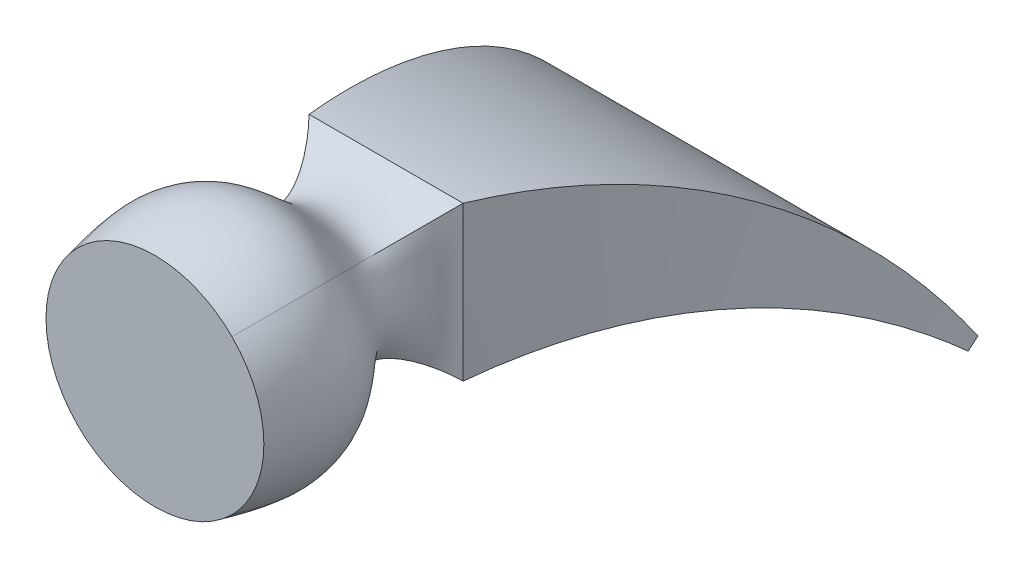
ISO-10303-21;
HEADER;
FILE_DESCRIPTION(('STEP AP214'),'2;1');
FILE_NAME('part.step','',(''),(''),'','','');
FILE_SCHEMA(('AUTOMOTIVE_DESIGN { 1 0 10303 214 1 1 1 1 }'));
ENDSEC;
DATA;
#1=APPLICATION_CONTEXT('core data for automotive mechanical design processes');
#2=APPLICATION_PROTOCOL_DEFINITION('international standard','automotive_design',2000,#1);
#3=PRODUCT_CONTEXT('',#1,'mechanical');
#4=PRODUCT('Part','Part','',(#3));
#5=PRODUCT_RELATED_PRODUCT_CATEGORY('part','',(#4));
#6=PRODUCT_DEFINITION_FORMATION('','',#4);
#7=PRODUCT_DEFINITION_CONTEXT('part definition',#1,'design');
#8=PRODUCT_DEFINITION('design','',#6,#7);
#9=PRODUCT_DEFINITION_SHAPE('','',#8);
#10=(LENGTH_UNIT() NAMED_UNIT(*) SI_UNIT(.MILLI.,.METRE.));
#11=(NAMED_UNIT(*) PLANE_ANGLE_UNIT() SI_UNIT($,.RADIAN.));
#12=(NAMED_UNIT(*) SI_UNIT($,.STERADIAN.) SOLID_ANGLE_UNIT());
#13=UNCERTAINTY_MEASURE_WITH_UNIT(LENGTH_MEASURE(1.E-05),#10,'distance_accuracy_value','');
#14=(GEOMETRIC_REPRESENTATION_CONTEXT(3) GLOBAL_UNCERTAINTY_ASSIGNED_CONTEXT((#13)) GLOBAL_UNIT_ASSIGNED_CONTEXT((#10,
#11,#12)) REPRESENTATION_CONTEXT('',''));
#15=CARTESIAN_POINT('',(0.,0.,0.));
#16=DIRECTION('',(0.,0.,1.));
#17=DIRECTION('',(1.,0.,0.));
#18=AXIS2_PLACEMENT_3D('',#15,#16,#17);
#19=CARTESIAN_POINT('',(0.,0.,90.));
#20=DIRECTION('',(0.,0.,1.));
#21=DIRECTION('',(1.,0.,0.));
#22=AXIS2_PLACEMENT_3D('',#19,#20,#21);
#23=PLANE('',#22);
#24=CARTESIAN_POINT('',(-30.,30.,90.));
#25=CARTESIAN_POINT('',(-13.442549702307,46.557450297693,90.));
#26=CARTESIAN_POINT('',(13.442549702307,46.557450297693,90.));
#27=CARTESIAN_POINT('',(30.,30.,90.));
#28=B_SPLINE_CURVE_WITH_KNOTS('',3,(#24,#25,#26,#27),.UNSPECIFIED.,.F.,.F.,(4,4),(0.,1.),.UNSPECIFIED.);
#29=CARTESIAN_POINT('',(30.,30.,90.));
#30=VERTEX_POINT('',#29);
#31=CARTESIAN_POINT('',(-30.,30.,90.));
#32=VERTEX_POINT('',#31);
#33=EDGE_CURVE('E13',#30,#32,#28,.F.);
#34=ORIENTED_EDGE('',*,*,#33,.T.);
#35=CARTESIAN_POINT('',(-30.,-30.,90.));
#36=CARTESIAN_POINT('',(-46.557450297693,-13.442549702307,90.));
#37=CARTESIAN_POINT('',(-46.557450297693,13.442549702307,90.));
#38=CARTESIAN_POINT('',(-30.,30.,90.));
#39=B_SPLINE_CURVE_WITH_KNOTS('',3,(#35,#36,#37,#38),.UNSPECIFIED.,.F.,.F.,(4,4),(0.,1.),.UNSPECIFIED.);
#40=CARTESIAN_POINT('',(-30.,-30.,90.));
#41=VERTEX_POINT('',#40);
#42=EDGE_CURVE('E253',#32,#41,#39,.F.);
#43=ORIENTED_EDGE('',*,*,#42,.T.);
#44=CARTESIAN_POINT('',(30.,-30.,90.));
#45=CARTESIAN_POINT('',(13.442549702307,-46.557450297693,90.));
#46=CARTESIAN_POINT('',(-13.442549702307,-46.557450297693,90.));
#47=CARTESIAN_POINT('',(-30.,-30.,90.));
#48=B_SPLINE_CURVE_WITH_KNOTS('',3,(#44,#45,#46,#47),.UNSPECIFIED.,.F.,.F.,(4,4),(0.,1.),.UNSPECIFIED.);
#49=CARTESIAN_POINT('',(30.,-30.,90.));
#50=VERTEX_POINT('',#49);
#51=EDGE_CURVE('E537',#41,#50,#48,.F.);
#52=ORIENTED_EDGE('',*,*,#51,.T.);
#53=CARTESIAN_POINT('',(30.,30.,90.));
#54=CARTESIAN_POINT('',(46.557450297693,13.442549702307,90.));
#55=CARTESIAN_POINT('',(46.557450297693,-13.442549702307,90.));
#56=CARTESIAN_POINT('',(30.,-30.,90.));
#57=B_SPLINE_CURVE_WITH_KNOTS('',3,(#53,#54,#55,#56),.UNSPECIFIED.,.F.,.F.,(4,4),(0.,1.),.UNSPECIFIED.);
#58=EDGE_CURVE('E534',#50,#30,#57,.F.);
#59=ORIENTED_EDGE('',*,*,#58,.T.);
#60=EDGE_LOOP('',(#34,#43,#52,#59));
#61=FACE_BOUND('',#60,.T.);
#62=ADVANCED_FACE('F241',(#61),#23,.T.);
#63=CARTESIAN_POINT('',(30.,30.,90.));
#64=CARTESIAN_POINT('',(31.5721069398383,31.5721069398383,80.5150489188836));
#65=CARTESIAN_POINT('',(37.4126053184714,37.4126053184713,48.7267112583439));
#66=CARTESIAN_POINT('',(10.0020018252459,10.0020018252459,28.4713034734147));
#67=CARTESIAN_POINT('',(24.5234086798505,24.5234086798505,5.55555555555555));
#68=CARTESIAN_POINT('',(30.,30.,0.));
#69=CARTESIAN_POINT('',(46.557450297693,13.442549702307,90.));
#70=CARTESIAN_POINT('',(48.1295572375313,13.9665853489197,80.5150489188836));
#71=CARTESIAN_POINT('',(55.6626313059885,16.2653307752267,48.7267112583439));
#72=CARTESIAN_POINT('',(22.2842511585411,5.88766998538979,28.4713034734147));
#73=CARTESIAN_POINT('',(24.5234086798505,8.17446955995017,5.55555555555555));
#74=CARTESIAN_POINT('',(30.,10.,0.));
#75=CARTESIAN_POINT('',(46.557450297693,-13.442549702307,90.));
#76=CARTESIAN_POINT('',(48.1295572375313,-13.9665853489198,80.5150489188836));
#77=CARTESIAN_POINT('',(55.6626313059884,-16.2653307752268,48.7267112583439));
#78=CARTESIAN_POINT('',(22.2842511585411,-5.8876699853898,28.4713034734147));
#79=CARTESIAN_POINT('',(24.5234086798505,-8.17446955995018,5.55555555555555));
#80=CARTESIAN_POINT('',(30.,-10.,0.));
#81=CARTESIAN_POINT('',(30.,-30.,90.));
#82=CARTESIAN_POINT('',(31.5721069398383,-31.5721069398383,80.5150489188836));
#83=CARTESIAN_POINT('',(37.4126053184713,-37.4126053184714,48.7267112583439));
#84=CARTESIAN_POINT('',(10.0020018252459,-10.0020018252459,28.4713034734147));
#85=CARTESIAN_POINT('',(24.5234086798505,-24.5234086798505,5.55555555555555));
#86=CARTESIAN_POINT('',(30.,-30.,0.));
#87=B_SPLINE_SURFACE_WITH_KNOTS('',3,3,((#63,#64,#65,#66,#67,#68),(#69,#70,#71,#72,#73,#74),
(#75,#76,#77,#78,#79,#80),(#81,#82,#83,#84,#85,#86)),.UNSPECIFIED.,.F.,.F.,.F.,(4,4),(4,1,1,4),
(0.,1.),(0.,0.406260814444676,0.715773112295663,1.),.UNSPECIFIED.);
#88=CARTESIAN_POINT('',(30.,-30.,90.));
#89=CARTESIAN_POINT('',(31.5721069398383,-31.5721069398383,80.5150489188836));
#90=CARTESIAN_POINT('',(37.4126053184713,-37.4126053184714,48.7267112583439));
#91=CARTESIAN_POINT('',(10.0020018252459,-10.0020018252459,28.4713034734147));
#92=CARTESIAN_POINT('',(24.5234086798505,-24.5234086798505,5.55555555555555));
#93=CARTESIAN_POINT('',(30.,-30.,0.));
#94=B_SPLINE_CURVE_WITH_KNOTS('',3,(#88,#89,#90,#91,#92,#93),.UNSPECIFIED.,.F.,.F.,(4,1,1,4),
(0.,0.406260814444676,0.715773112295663,1.),.UNSPECIFIED.);
#95=CARTESIAN_POINT('',(30.,-30.,0.));
#96=VERTEX_POINT('',#95);
#97=EDGE_CURVE('E512',#50,#96,#94,.T.);
#98=DIRECTION('',(0.,1.,0.));
#99=VECTOR('',#98,1.);
#100=CARTESIAN_POINT('',(30.0000000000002,7.12971348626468E-13,0.));
#101=LINE('',#100,#99);
#102=CARTESIAN_POINT('',(30.,30.,0.));
#103=VERTEX_POINT('',#102);
#104=EDGE_CURVE('E510',#96,#103,#101,.T.);
#105=CARTESIAN_POINT('',(30.,30.,0.));
#106=CARTESIAN_POINT('',(24.5234086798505,24.5234086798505,5.55555555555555));
#107=CARTESIAN_POINT('',(10.0020018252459,10.0020018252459,28.4713034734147));
#108=CARTESIAN_POINT('',(37.4126053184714,37.4126053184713,48.7267112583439));
#109=CARTESIAN_POINT('',(31.5721069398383,31.5721069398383,80.5150489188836));
#110=CARTESIAN_POINT('',(30.,30.,90.));
#111=B_SPLINE_CURVE_WITH_KNOTS('',3,(#105,#106,#107,#108,#109,#110),.UNSPECIFIED.,.F.,.F.,(4,1,
1,4),(0.,0.284226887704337,0.593739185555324,1.),.UNSPECIFIED.);
#112=EDGE_CURVE('E319',#103,#30,#111,.T.);
#113=ORIENTED_EDGE('',*,*,#58,.F.);
#114=ORIENTED_EDGE('',*,*,#97,.T.);
#115=ORIENTED_EDGE('',*,*,#104,.T.);
#116=ORIENTED_EDGE('',*,*,#112,.T.);
#117=EDGE_LOOP('',(#113,#114,#115,#116));
#118=FACE_BOUND('',#117,.T.);
#119=ADVANCED_FACE('F477',(#118),#87,.T.);
#120=CARTESIAN_POINT('',(30.,-30.,90.));
#121=CARTESIAN_POINT('',(31.5721069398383,-31.5721069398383,80.5150489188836));
#122=CARTESIAN_POINT('',(37.4126053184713,-37.4126053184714,48.7267112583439));
#123=CARTESIAN_POINT('',(10.0020018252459,-10.0020018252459,28.4713034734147));
#124=CARTESIAN_POINT('',(24.5234086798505,-24.5234086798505,5.55555555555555));
#125=CARTESIAN_POINT('',(30.,-30.,0.));
#126=CARTESIAN_POINT('',(13.442549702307,-46.557450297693,90.));
#127=CARTESIAN_POINT('',(13.9665853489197,-48.1295572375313,80.5150489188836));
#128=CARTESIAN_POINT('',(16.2653307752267,-55.6626313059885,48.7267112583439));
#129=CARTESIAN_POINT('',(5.88766998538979,-22.2842511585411,28.4713034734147));
#130=CARTESIAN_POINT('',(8.17446955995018,-24.5234086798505,5.55555555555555));
#131=CARTESIAN_POINT('',(10.,-30.,0.));
#132=CARTESIAN_POINT('',(-13.442549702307,-46.557450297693,90.));
#133=CARTESIAN_POINT('',(-13.9665853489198,-48.1295572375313,80.5150489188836));
#134=CARTESIAN_POINT('',(-16.2653307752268,-55.6626313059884,48.7267112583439));
#135=CARTESIAN_POINT('',(-5.8876699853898,-22.2842511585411,28.4713034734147));
#136=CARTESIAN_POINT('',(-8.17446955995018,-24.5234086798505,5.55555555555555));
#137=CARTESIAN_POINT('',(-10.,-30.,0.));
#138=CARTESIAN_POINT('',(-30.,-30.,90.));
#139=CARTESIAN_POINT('',(-31.5721069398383,-31.5721069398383,80.5150489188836));
#140=CARTESIAN_POINT('',(-37.4126053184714,-37.4126053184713,48.7267112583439));
#141=CARTESIAN_POINT('',(-10.0020018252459,-10.0020018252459,28.4713034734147));
#142=CARTESIAN_POINT('',(-24.5234086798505,-24.5234086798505,5.55555555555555));
#143=CARTESIAN_POINT('',(-30.,-30.,0.));
#144=B_SPLINE_SURFACE_WITH_KNOTS('',3,3,((#120,#121,#122,#123,#124,#125),(#126,#127,#128,#129,
#130,#131),(#132,#133,#134,#135,#136,#137),(#138,#139,#140,#141,#142,#143)),.UNSPECIFIED.,.F.,
.F.,.F.,(4,4),(4,1,1,4),(0.,1.),(0.,0.406260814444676,0.715773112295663,1.),.UNSPECIFIED.);
#145=CARTESIAN_POINT('',(-30.,-30.,90.));
#146=CARTESIAN_POINT('',(-31.5721069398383,-31.5721069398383,80.5150489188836));
#147=CARTESIAN_POINT('',(-37.4126053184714,-37.4126053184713,48.7267112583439));
#148=CARTESIAN_POINT('',(-10.0020018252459,-10.0020018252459,28.4713034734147));
#149=CARTESIAN_POINT('',(-24.5234086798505,-24.5234086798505,5.55555555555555));
#150=CARTESIAN_POINT('',(-30.,-30.,0.));
#151=B_SPLINE_CURVE_WITH_KNOTS('',3,(#145,#146,#147,#148,#149,#150),.UNSPECIFIED.,.F.,.F.,(4,1,
1,4),(0.,0.406260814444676,0.715773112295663,1.),.UNSPECIFIED.);
#152=CARTESIAN_POINT('',(-30.,-30.,0.));
#153=VERTEX_POINT('',#152);
#154=EDGE_CURVE('E461',#41,#153,#151,.T.);
#155=DIRECTION('',(1.,0.,0.));
#156=VECTOR('',#155,1.);
#157=CARTESIAN_POINT('',(0.,-30.,0.));
#158=LINE('',#157,#156);
#159=EDGE_CURVE('E324',#153,#96,#158,.T.);
#160=ORIENTED_EDGE('',*,*,#51,.F.);
#161=ORIENTED_EDGE('',*,*,#154,.T.);
#162=ORIENTED_EDGE('',*,*,#159,.T.);
#163=ORIENTED_EDGE('',*,*,#97,.F.);
#164=EDGE_LOOP('',(#160,#161,#162,#163));
#165=FACE_BOUND('',#164,.T.);
#166=ADVANCED_FACE('F466',(#165),#144,.T.);
#167=CARTESIAN_POINT('',(-30.,30.,90.));
#168=CARTESIAN_POINT('',(-31.5721069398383,31.5721069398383,80.5150489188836));
#169=CARTESIAN_POINT('',(-37.4126053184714,37.4126053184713,48.7267112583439));
#170=CARTESIAN_POINT('',(-10.0020018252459,10.0020018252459,28.4713034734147));
#171=CARTESIAN_POINT('',(-24.5234086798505,24.5234086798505,5.55555555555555));
#172=CARTESIAN_POINT('',(-30.,30.,0.));
#173=CARTESIAN_POINT('',(-13.442549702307,46.557450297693,90.));
#174=CARTESIAN_POINT('',(-13.9665853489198,48.1295572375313,80.5150489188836));
#175=CARTESIAN_POINT('',(-16.2653307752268,55.6626313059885,48.7267112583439));
#176=CARTESIAN_POINT('',(-5.8876699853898,22.2842511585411,28.4713034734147));
#177=CARTESIAN_POINT('',(-8.17446955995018,24.5234086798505,5.55555555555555));
#178=CARTESIAN_POINT('',(-10.,30.,0.));
#179=CARTESIAN_POINT('',(13.442549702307,46.557450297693,90.));
#180=CARTESIAN_POINT('',(13.9665853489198,48.1295572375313,80.5150489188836));
#181=CARTESIAN_POINT('',(16.2653307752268,55.6626313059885,48.7267112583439));
#182=CARTESIAN_POINT('',(5.88766998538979,22.2842511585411,28.4713034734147));
#183=CARTESIAN_POINT('',(8.17446955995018,24.5234086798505,5.55555555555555));
#184=CARTESIAN_POINT('',(10.,30.,0.));
#185=CARTESIAN_POINT('',(30.,30.,90.));
#186=CARTESIAN_POINT('',(31.5721069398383,31.5721069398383,80.5150489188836));
#187=CARTESIAN_POINT('',(37.4126053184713,37.4126053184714,48.7267112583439));
#188=CARTESIAN_POINT('',(10.0020018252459,10.0020018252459,28.4713034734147));
#189=CARTESIAN_POINT('',(24.5234086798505,24.5234086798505,5.55555555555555));
#190=CARTESIAN_POINT('',(30.,30.,0.));
#191=B_SPLINE_SURFACE_WITH_KNOTS('',3,3,((#167,#168,#169,#170,#171,#172),(#173,#174,#175,#176,
#177,#178),(#179,#180,#181,#182,#183,#184),(#185,#186,#187,#188,#189,#190)),.UNSPECIFIED.,.F.,
.F.,.F.,(4,4),(4,1,1,4),(0.,1.),(0.,0.406260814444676,0.715773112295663,1.),.UNSPECIFIED.);
#192=DIRECTION('',(-1.,0.,0.));
#193=VECTOR('',#192,1.);
#194=CARTESIAN_POINT('',(-4.54497550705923E-13,29.9999999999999,0.));
#195=LINE('',#194,#193);
#196=CARTESIAN_POINT('',(-30.,30.,0.));
#197=VERTEX_POINT('',#196);
#198=EDGE_CURVE('E312',#103,#197,#195,.T.);
#199=CARTESIAN_POINT('',(-30.,30.,90.));
#200=CARTESIAN_POINT('',(-31.5721069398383,31.5721069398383,80.5150489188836));
#201=CARTESIAN_POINT('',(-37.4126053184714,37.4126053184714,48.7267112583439));
#202=CARTESIAN_POINT('',(-10.0020018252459,10.0020018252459,28.4713034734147));
#203=CARTESIAN_POINT('',(-24.5234086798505,24.5234086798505,5.55555555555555));
#204=CARTESIAN_POINT('',(-30.,30.,0.));
#205=B_SPLINE_CURVE_WITH_KNOTS('',3,(#199,#200,#201,#202,#203,#204),.UNSPECIFIED.,.F.,.F.,(4,1,
1,4),(0.,0.406260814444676,0.715773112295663,1.),.UNSPECIFIED.);
#206=EDGE_CURVE('E303',#32,#197,#205,.T.);
#207=ORIENTED_EDGE('',*,*,#33,.F.);
#208=ORIENTED_EDGE('',*,*,#112,.F.);
#209=ORIENTED_EDGE('',*,*,#198,.T.);
#210=ORIENTED_EDGE('',*,*,#206,.F.);
#211=EDGE_LOOP('',(#207,#208,#209,#210));
#212=FACE_BOUND('',#211,.T.);
#213=ADVANCED_FACE('F317',(#212),#191,.T.);
#214=CARTESIAN_POINT('',(-30.,-30.,90.));
#215=CARTESIAN_POINT('',(-31.5721069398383,-31.5721069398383,80.5150489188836));
#216=CARTESIAN_POINT('',(-37.4126053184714,-37.4126053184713,48.7267112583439));
#217=CARTESIAN_POINT('',(-10.0020018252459,-10.0020018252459,28.4713034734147));
#218=CARTESIAN_POINT('',(-24.5234086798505,-24.5234086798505,5.55555555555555));
#219=CARTESIAN_POINT('',(-30.,-30.,0.));
#220=CARTESIAN_POINT('',(-46.557450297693,-13.442549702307,90.));
#221=CARTESIAN_POINT('',(-48.1295572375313,-13.9665853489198,80.5150489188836));
#222=CARTESIAN_POINT('',(-55.6626313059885,-16.2653307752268,48.7267112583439));
#223=CARTESIAN_POINT('',(-22.2842511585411,-5.88766998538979,28.4713034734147));
#224=CARTESIAN_POINT('',(-24.5234086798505,-8.17446955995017,5.55555555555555));
#225=CARTESIAN_POINT('',(-30.,-10.,0.));
#226=CARTESIAN_POINT('',(-46.557450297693,13.442549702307,90.));
#227=CARTESIAN_POINT('',(-48.1295572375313,13.9665853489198,80.5150489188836));
#228=CARTESIAN_POINT('',(-55.6626313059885,16.2653307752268,48.7267112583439));
#229=CARTESIAN_POINT('',(-22.2842511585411,5.8876699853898,28.4713034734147));
#230=CARTESIAN_POINT('',(-24.5234086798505,8.17446955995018,5.55555555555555));
#231=CARTESIAN_POINT('',(-30.,10.,0.));
#232=CARTESIAN_POINT('',(-30.,30.,90.));
#233=CARTESIAN_POINT('',(-31.5721069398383,31.5721069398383,80.5150489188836));
#234=CARTESIAN_POINT('',(-37.4126053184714,37.4126053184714,48.7267112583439));
#235=CARTESIAN_POINT('',(-10.0020018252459,10.0020018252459,28.4713034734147));
#236=CARTESIAN_POINT('',(-24.5234086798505,24.5234086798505,5.55555555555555));
#237=CARTESIAN_POINT('',(-30.,30.,0.));
#238=B_SPLINE_SURFACE_WITH_KNOTS('',3,3,((#214,#215,#216,#217,#218,#219),(#220,#221,#222,#223,
#224,#225),(#226,#227,#228,#229,#230,#231),(#232,#233,#234,#235,#236,#237)),.UNSPECIFIED.,.F.,
.F.,.F.,(4,4),(4,1,1,4),(0.,1.),(0.,0.406260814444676,0.715773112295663,1.),.UNSPECIFIED.);
#239=DIRECTION('',(0.,-1.,0.));
#240=VECTOR('',#239,1.);
#241=CARTESIAN_POINT('',(-29.9999999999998,-5.98479599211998E-13,0.));
#242=LINE('',#241,#240);
#243=EDGE_CURVE('E293',#197,#153,#242,.T.);
#244=ORIENTED_EDGE('',*,*,#42,.F.);
#245=ORIENTED_EDGE('',*,*,#206,.T.);
#246=ORIENTED_EDGE('',*,*,#243,.T.);
#247=ORIENTED_EDGE('',*,*,#154,.F.);
#248=EDGE_LOOP('',(#244,#245,#246,#247));
#249=FACE_BOUND('',#248,.T.);
#250=ADVANCED_FACE('F308',(#249),#238,.T.);
#251=CARTESIAN_POINT('',(-75.,-73.2383057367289,-151.698786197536));
#252=DIRECTION('',(0.,0.766044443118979,0.642787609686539));
#253=DIRECTION('',(1.,0.,0.));
#254=AXIS2_PLACEMENT_3D('',#251,#252,#253);
#255=PLANE('',#254);
#256=DIRECTION('',(0.,-0.642787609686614,0.766044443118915));
#257=VECTOR('',#256,1.);
#258=CARTESIAN_POINT('',(-75.,-71.6313367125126,-153.613897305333));
#259=LINE('',#258,#257);
#260=CARTESIAN_POINT('',(-75.,-70.0243676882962,-155.529008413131));
#261=VERTEX_POINT('',#260);
#262=CARTESIAN_POINT('',(-75.,-73.2383057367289,-151.698786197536));
#263=VERTEX_POINT('',#262);
#264=EDGE_CURVE('E331',#261,#263,#259,.T.);
#265=ORIENTED_EDGE('',*,*,#264,.F.);
#266=DIRECTION('',(-1.,0.,0.));
#267=VECTOR('',#266,1.);
#268=CARTESIAN_POINT('',(-2.44249065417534E-12,-70.024367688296,-155.529008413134));
#269=LINE('',#268,#267);
#270=CARTESIAN_POINT('',(75.,-70.0243676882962,-155.529008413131));
#271=VERTEX_POINT('',#270);
#272=EDGE_CURVE('E329',#271,#261,#269,.T.);
#273=ORIENTED_EDGE('',*,*,#272,.F.);
#274=DIRECTION('',(0.,0.642787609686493,-0.766044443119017));
#275=VECTOR('',#274,1.);
#276=CARTESIAN_POINT('',(75.,-71.6313367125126,-153.613897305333));
#277=LINE('',#276,#275);
#278=CARTESIAN_POINT('',(75.,-73.2383057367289,-151.698786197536));
#279=VERTEX_POINT('',#278);
#280=EDGE_CURVE('E384',#279,#271,#277,.T.);
#281=ORIENTED_EDGE('',*,*,#280,.F.);
#282=DIRECTION('',(1.,0.,0.));
#283=VECTOR('',#282,1.);
#284=CARTESIAN_POINT('',(1.7052331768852E-12,-73.2383057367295,-151.698786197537));
#285=LINE('',#284,#283);
#286=EDGE_CURVE('E407',#263,#279,#285,.T.);
#287=ORIENTED_EDGE('',*,*,#286,.F.);
#288=EDGE_LOOP('',(#265,#273,#281,#287));
#289=FACE_BOUND('',#288,.T.);
#290=ADVANCED_FACE('F243',(#289),#255,.F.);
#291=CARTESIAN_POINT('',(-75.,-91.1463685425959,-130.356788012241));
#292=CARTESIAN_POINT('',(-75.,-78.1363473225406,-145.861527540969));
#293=CARTESIAN_POINT('',(-75.,-65.1263261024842,-161.366267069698));
#294=CARTESIAN_POINT('',(-75.,-52.1163048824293,-176.871006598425));
#295=CARTESIAN_POINT('',(-70.1787201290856,-78.9584578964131,-120.129826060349));
#296=CARTESIAN_POINT('',(-70.1787233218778,-64.4988050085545,-134.418169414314));
#297=CARTESIAN_POINT('',(-70.1787251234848,-50.0391511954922,-148.706511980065));
#298=CARTESIAN_POINT('',(-70.1787265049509,-35.5794968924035,-162.994854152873));
#299=CARTESIAN_POINT('',(-62.1428863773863,-61.0572602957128,-100.213730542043));
#300=CARTESIAN_POINT('',(-62.142886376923,-44.4684167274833,-112.133230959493));
#301=CARTESIAN_POINT('',(-62.1428863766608,-27.8795731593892,-124.052731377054));
#302=CARTESIAN_POINT('',(-62.1428863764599,-11.2907295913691,-135.972231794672));
#303=CARTESIAN_POINT('',(-51.9642856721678,-44.9227971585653,-70.5858759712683));
#304=CARTESIAN_POINT('',(-51.9642856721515,-26.4149077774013,-78.981415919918));
#305=CARTESIAN_POINT('',(-51.9642856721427,-7.90701839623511,-87.3769558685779));
#306=CARTESIAN_POINT('',(-51.9642856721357,10.6008709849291,-95.7724958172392));
#307=CARTESIAN_POINT('',(-41.7856839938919,-33.6095763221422,-38.8897060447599));
#308=CARTESIAN_POINT('',(-41.785683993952,-13.7560835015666,-43.5152784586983));
#309=CARTESIAN_POINT('',(-41.7856839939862,6.09740931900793,-48.1408508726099));
#310=CARTESIAN_POINT('',(-41.7856839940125,25.9509021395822,-52.7664232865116));
#311=CARTESIAN_POINT('',(-34.8212798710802,-30.3599305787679,-15.9102456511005));
#312=CARTESIAN_POINT('',(-34.8212766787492,-10.1199223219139,-17.8026123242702));
#313=CARTESIAN_POINT('',(-34.821274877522,10.1200859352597,-19.6949802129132));
#314=CARTESIAN_POINT('',(-34.8212734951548,30.3600941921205,-21.5873487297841));
#315=CARTESIAN_POINT('',(-30.,-30.36,0.));
#316=CARTESIAN_POINT('',(-30.0000000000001,-10.1200000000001,0.));
#317=CARTESIAN_POINT('',(-30.,10.1200000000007,0.));
#318=CARTESIAN_POINT('',(-30.,30.36,0.));
#319=B_SPLINE_SURFACE_WITH_KNOTS('',3,3,((#291,#292,#293,#294),(#295,#296,#297,#298),(#299,#300,
#301,#302),(#303,#304,#305,#306),(#307,#308,#309,#310),(#311,#312,#313,#314),(#315,#316,#317,
#318)),.UNSPECIFIED.,.F.,.F.,.F.,(4,1,1,1,4),(4,4),(0.,0.321429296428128,0.535714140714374,
0.678570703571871,1.),(0.,1.),.UNSPECIFIED.);
#320=CARTESIAN_POINT('',(-30.,30.,0.));
#321=CARTESIAN_POINT('',(-30.9342195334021,29.4290971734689,-4.17642962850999));
#322=CARTESIAN_POINT('',(-31.8716699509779,28.7417679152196,-8.33623197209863));
#323=CARTESIAN_POINT('',(-33.7466319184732,27.1421054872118,-16.5807449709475));
#324=CARTESIAN_POINT('',(-34.6840974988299,26.2313740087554,-20.6657769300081));
#325=CARTESIAN_POINT('',(-36.5590841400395,24.1919290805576,-28.7489334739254));
#326=CARTESIAN_POINT('',(-37.496558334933,23.064795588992,-32.7474674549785));
#327=CARTESIAN_POINT('',(-39.3715636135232,20.599501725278,-40.646153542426));
#328=CARTESIAN_POINT('',(-40.3090468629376,19.2628993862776,-44.5468031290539));
#329=CARTESIAN_POINT('',(-42.1840735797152,16.3856143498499,-52.2386467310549));
#330=CARTESIAN_POINT('',(-43.1215685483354,14.8464615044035,-56.0304245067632));
#331=CARTESIAN_POINT('',(-44.996594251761,11.570803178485,-63.4936577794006));
#332=CARTESIAN_POINT('',(-45.9340765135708,9.83579218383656,-67.1657811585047));
#333=CARTESIAN_POINT('',(-47.8090862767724,6.17730605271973,-74.3798630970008));
#334=CARTESIAN_POINT('',(-48.7465646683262,4.25528071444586,-77.922569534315));
#335=CARTESIAN_POINT('',(-50.621571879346,0.231657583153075,-84.8682822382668));
#336=CARTESIAN_POINT('',(-51.5590507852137,-1.86853315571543,-88.2721168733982));
#337=CARTESIAN_POINT('',(-53.4340555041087,-6.23880526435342,-94.9313248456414));
#338=CARTESIAN_POINT('',(-54.3715306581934,-8.50752928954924,-98.1876031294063));
#339=CARTESIAN_POINT('',(-56.2465378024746,-13.2046150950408,-104.543686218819));
#340=CARTESIAN_POINT('',(-57.1840181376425,-15.6316727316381,-107.644469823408));
#341=CARTESIAN_POINT('',(-59.0590399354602,-20.6355869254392,-113.681721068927));
#342=CARTESIAN_POINT('',(-59.9965290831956,-23.2111950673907,-116.619239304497));
#343=CARTESIAN_POINT('',(-61.8715500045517,-28.5021305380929,-122.322619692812));
#344=CARTESIAN_POINT('',(-62.8090292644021,-31.2162719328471,-125.089599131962));
#345=CARTESIAN_POINT('',(-64.6840378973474,-36.7724476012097,-130.446388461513));
#346=CARTESIAN_POINT('',(-65.6215137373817,-39.6133649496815,-133.037375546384));
#347=CARTESIAN_POINT('',(-67.4965159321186,-45.411678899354,-138.036783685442));
#348=CARTESIAN_POINT('',(-68.4339875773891,-48.3680241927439,-140.446444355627));
#349=CARTESIAN_POINT('',(-70.3089857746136,-54.3860036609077,-145.078130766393));
#350=CARTESIAN_POINT('',(-71.2464566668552,-57.4466554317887,-147.301454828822));
#351=CARTESIAN_POINT('',(-73.1214407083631,-63.662202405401,-151.555621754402));
#352=CARTESIAN_POINT('',(-74.0588979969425,-66.8161909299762,-153.587814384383));
#353=CARTESIAN_POINT('',(-75.,-70.0243676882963,-155.529008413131));
#354=B_SPLINE_CURVE_WITH_KNOTS('',3,(#320,#321,#322,#323,#324,#325,#326,#327,#328,#329,#330,
#331,#332,#333,#334,#335,#336,#337,#338,#339,#340,#341,#342,#343,#344,#345,#346,#347,#348,#349,
#350,#351,#352,#353),.UNSPECIFIED.,.F.,.F.,(4,2,2,2,2,2,2,2,2,2,2,2,2,2,2,2,4),(0.,
12.9510719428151,25.811873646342,38.5821226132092,51.2615383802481,63.8501630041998,
76.348507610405,88.7566935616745,101.074673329,113.302411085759,125.43975288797,
137.486821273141,149.443998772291,161.311138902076,173.087942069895,184.774345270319,
196.37080138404),.UNSPECIFIED.);
#355=EDGE_CURVE('E297',#197,#261,#354,.T.);
#356=CARTESIAN_POINT('',(-30.,-29.9999999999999,0.));
#357=CARTESIAN_POINT('',(-30.9426112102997,-29.4239307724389,-3.11719668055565));
#358=CARTESIAN_POINT('',(-31.8810737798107,-28.9367052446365,-6.25190727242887));
#359=CARTESIAN_POINT('',(-33.7579408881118,-28.1353745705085,-12.5736983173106));
#360=CARTESIAN_POINT('',(-34.6962732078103,-27.8228199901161,-15.7609970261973));
#361=CARTESIAN_POINT('',(-36.5728581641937,-27.3743474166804,-22.1785525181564));
#362=CARTESIAN_POINT('',(-37.5110375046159,-27.2400072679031,-25.4089405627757));
#363=CARTESIAN_POINT('',(-39.3873291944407,-27.1514282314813,-31.902794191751));
#364=CARTESIAN_POINT('',(-40.3253692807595,-27.1987738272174,-35.1663020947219));
#365=CARTESIAN_POINT('',(-42.2013723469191,-27.47692790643,-41.7159317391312));
#366=CARTESIAN_POINT('',(-43.1392653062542,-27.7093104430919,-45.0020066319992));
#367=CARTESIAN_POINT('',(-45.0150343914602,-28.3612302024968,-51.5857193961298));
#368=CARTESIAN_POINT('',(-45.9528439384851,-28.7823261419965,-54.8832218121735));
#369=CARTESIAN_POINT('',(-47.8284043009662,-29.8133001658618,-61.4792493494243));
#370=CARTESIAN_POINT('',(-48.766088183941,-30.4247373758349,-64.777549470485));
#371=CARTESIAN_POINT('',(-50.6413719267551,-31.8368887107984,-71.3648487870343));
#372=CARTESIAN_POINT('',(-51.5789039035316,-32.6391610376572,-74.6535329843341));
#373=CARTESIAN_POINT('',(-53.453894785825,-34.4335551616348,-81.2107052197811));
#374=CARTESIAN_POINT('',(-54.3912867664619,-35.4272168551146,-84.4787908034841));
#375=CARTESIAN_POINT('',(-56.2659962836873,-37.6046914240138,-90.9833590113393));
#376=CARTESIAN_POINT('',(-57.2032490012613,-38.7900099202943,-94.219356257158));
#377=CARTESIAN_POINT('',(-59.077722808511,-41.3510909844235,-100.647817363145));
#378=CARTESIAN_POINT('',(-60.0148817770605,-42.7283225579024,-103.839713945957));
#379=CARTESIAN_POINT('',(-61.8891143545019,-45.6715021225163,-110.169020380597));
#380=CARTESIAN_POINT('',(-62.8261258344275,-47.2388878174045,-113.305779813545));
#381=CARTESIAN_POINT('',(-64.7000903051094,-50.5604637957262,-119.513587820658));
#382=CARTESIAN_POINT('',(-65.6369822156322,-52.3160550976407,-122.583905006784));
#383=CARTESIAN_POINT('',(-67.5106984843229,-56.011275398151,-128.647878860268));
#384=CARTESIAN_POINT('',(-68.447462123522,-57.9522665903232,-131.640723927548));
#385=CARTESIAN_POINT('',(-70.3209022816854,-62.0147138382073,-137.539056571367));
#386=CARTESIAN_POINT('',(-71.2575183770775,-64.1374871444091,-140.443655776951));
#387=CARTESIAN_POINT('',(-73.1306783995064,-68.5597483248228,-146.15430802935));
#388=CARTESIAN_POINT('',(-74.0671636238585,-70.8604966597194,-148.959404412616));
#389=CARTESIAN_POINT('',(-75.,-73.2383057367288,-151.698786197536));
#390=B_SPLINE_CURVE_WITH_KNOTS('',3,(#356,#357,#358,#359,#360,#361,#362,#363,#364,#365,#366,
#367,#368,#369,#370,#371,#372,#373,#374,#375,#376,#377,#378,#379,#380,#381,#382,#383,#384,#385,
#386,#387,#388,#389),.UNSPECIFIED.,.F.,.F.,(4,2,2,2,2,2,2,2,2,2,2,2,2,2,2,2,4),(0.,
9.92001909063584,19.9267542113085,30.021506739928,40.2044949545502,50.475044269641,
60.8320351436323,71.2761996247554,81.8087614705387,92.4299024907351,103.138943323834,
113.934988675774,124.818447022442,135.789437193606,146.848353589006,157.995575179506,
169.230618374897),.UNSPECIFIED.);
#391=EDGE_CURVE('E300',#153,#263,#390,.T.);
#392=ORIENTED_EDGE('',*,*,#355,.T.);
#393=ORIENTED_EDGE('',*,*,#264,.T.);
#394=ORIENTED_EDGE('',*,*,#391,.F.);
#395=ORIENTED_EDGE('',*,*,#243,.F.);
#396=EDGE_LOOP('',(#392,#393,#394,#395));
#397=FACE_BOUND('',#396,.T.);
#398=ADVANCED_FACE('F294',(#397),#319,.T.);
#399=CARTESIAN_POINT('',(-75.9,-30.,0.));
#400=CARTESIAN_POINT('',(-25.2999999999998,-29.9999999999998,0.));
#401=CARTESIAN_POINT('',(25.299999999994,-29.9999999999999,0.));
#402=CARTESIAN_POINT('',(75.9000000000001,-30.,0.));
#403=CARTESIAN_POINT('',(-75.9,-26.8644013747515,-16.9680111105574));
#404=CARTESIAN_POINT('',(-25.3000000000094,-26.8644013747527,-16.9680111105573));
#405=CARTESIAN_POINT('',(25.2999999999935,-26.8644013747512,-16.9680111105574));
#406=CARTESIAN_POINT('',(75.8999999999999,-26.8644013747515,-16.9680111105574));
#407=CARTESIAN_POINT('',(-75.8999999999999,-25.9060151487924,-50.6513581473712));
#408=CARTESIAN_POINT('',(-25.3000000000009,-25.906015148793,-50.6513581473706));
#409=CARTESIAN_POINT('',(25.2999999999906,-25.9060151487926,-50.651358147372));
#410=CARTESIAN_POINT('',(75.8999999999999,-25.9060151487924,-50.6513581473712));
#411=CARTESIAN_POINT('',(-75.8999999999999,-36.4291911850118,-91.2994598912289));
#412=CARTESIAN_POINT('',(-25.2999999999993,-36.4291911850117,-91.2994598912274));
#413=CARTESIAN_POINT('',(25.2999999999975,-36.4291911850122,-91.299459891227));
#414=CARTESIAN_POINT('',(75.9,-36.4291911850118,-91.2994598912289));
#415=CARTESIAN_POINT('',(-75.9,-52.6278076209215,-124.798591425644));
#416=CARTESIAN_POINT('',(-25.2999999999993,-52.6278076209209,-124.798591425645));
#417=CARTESIAN_POINT('',(25.2999999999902,-52.6278076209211,-124.798591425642));
#418=CARTESIAN_POINT('',(75.9000000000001,-52.6278076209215,-124.798591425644));
#419=CARTESIAN_POINT('',(-75.9000000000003,-64.871981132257,-142.060261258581));
#420=CARTESIAN_POINT('',(-25.2999999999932,-64.8719811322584,-142.060261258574));
#421=CARTESIAN_POINT('',(25.2999999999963,-64.8719811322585,-142.060261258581));
#422=CARTESIAN_POINT('',(75.9000000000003,-64.871981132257,-142.060261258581));
#423=CARTESIAN_POINT('',(-75.9,-73.2383057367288,-151.698786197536));
#424=CARTESIAN_POINT('',(-25.2999999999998,-73.2383057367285,-151.698786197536));
#425=CARTESIAN_POINT('',(25.299999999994,-73.2383057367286,-151.698786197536));
#426=CARTESIAN_POINT('',(75.9000000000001,-73.2383057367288,-151.698786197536));
#427=B_SPLINE_SURFACE_WITH_KNOTS('',3,3,((#399,#400,#401,#402),(#403,#404,#405,#406),(#407,#408,
#409,#410),(#411,#412,#413,#414),(#415,#416,#417,#418),(#419,#420,#421,#422),(#423,#424,#425,
#426)),.UNSPECIFIED.,.F.,.F.,.F.,(4,1,1,1,4),(4,4),(0.,0.31729513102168,0.61278754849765,
0.765308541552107,1.),(0.,1.),.UNSPECIFIED.);
#428=CARTESIAN_POINT('',(30.,-30.,0.));
#429=CARTESIAN_POINT('',(30.941652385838,-29.4245232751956,-3.11406457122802));
#430=CARTESIAN_POINT('',(31.8791029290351,-28.9376610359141,-6.24561762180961));
#431=CARTESIAN_POINT('',(33.7540908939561,-28.1365463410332,-12.5616118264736));
#432=CARTESIAN_POINT('',(34.6915543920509,-27.8238734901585,-15.7462755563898));
#433=CARTESIAN_POINT('',(36.5665550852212,-27.3747797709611,-22.1588387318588));
#434=CARTESIAN_POINT('',(37.5040187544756,-27.2399514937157,-25.3868707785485));
#435=CARTESIAN_POINT('',(39.3790220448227,-27.1501232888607,-31.876253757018));
#436=CARTESIAN_POINT('',(40.3164894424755,-27.1967195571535,-35.1376474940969));
#437=CARTESIAN_POINT('',(42.1914975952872,-27.4732285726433,-41.6834548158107));
#438=CARTESIAN_POINT('',(43.128967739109,-27.7047359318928,-44.9678212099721));
#439=CARTESIAN_POINT('',(45.0039888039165,-28.3546892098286,-51.5488994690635));
#440=CARTESIAN_POINT('',(45.941470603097,-28.7747311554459,-54.8454732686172));
#441=CARTESIAN_POINT('',(47.8164942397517,-29.8032463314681,-61.4403591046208));
#442=CARTESIAN_POINT('',(48.7539673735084,-30.4133076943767,-64.7384426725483));
#443=CARTESIAN_POINT('',(50.628975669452,-31.8228875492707,-71.3255709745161));
#444=CARTESIAN_POINT('',(51.5664430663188,-32.6239786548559,-74.6142982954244));
#445=CARTESIAN_POINT('',(53.4414482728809,-34.416745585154,-81.1715280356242));
#446=CARTESIAN_POINT('',(54.3789196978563,-35.409975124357,-84.439624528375));
#447=CARTESIAN_POINT('',(56.2539278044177,-37.5873343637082,-90.944313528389));
#448=CARTESIAN_POINT('',(57.1913991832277,-38.7729942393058,-94.1804124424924));
#449=CARTESIAN_POINT('',(59.066409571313,-41.3345776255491,-100.609861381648));
#450=CARTESIAN_POINT('',(60.0038843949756,-42.7120004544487,-103.802632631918));
#451=CARTESIAN_POINT('',(61.8789112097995,-45.6562445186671,-110.133978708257));
#452=CARTESIAN_POINT('',(62.8163999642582,-47.2245352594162,-113.271888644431));
#453=CARTESIAN_POINT('',(64.6914284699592,-50.5477762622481,-119.482850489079));
#454=CARTESIAN_POINT('',(65.6289050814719,-52.3041571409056,-122.555155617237));
#455=CARTESIAN_POINT('',(67.5039112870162,-56.0007999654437,-128.62394999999));
#456=CARTESIAN_POINT('',(68.4413786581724,-57.9424477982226,-131.619614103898));
#457=CARTESIAN_POINT('',(70.3163654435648,-62.0065621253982,-137.523892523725));
#458=CARTESIAN_POINT('',(71.2538239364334,-64.1303642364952,-140.431606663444));
#459=CARTESIAN_POINT('',(73.1287854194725,-68.5555079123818,-146.148488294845));
#460=CARTESIAN_POINT('',(74.0662287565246,-70.8581339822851,-148.956681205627));
#461=CARTESIAN_POINT('',(74.9999999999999,-73.2383057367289,-151.698786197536));
#462=B_SPLINE_CURVE_WITH_KNOTS('',3,(#428,#429,#430,#431,#432,#433,#434,#435,#436,#437,#438,
#439,#440,#441,#442,#443,#444,#445,#446,#447,#448,#449,#450,#451,#452,#453,#454,#455,#456,#457,
#458,#459,#460,#461),.UNSPECIFIED.,.F.,.F.,(4,2,2,2,2,2,2,2,2,2,2,2,2,2,2,2,4),(0.,
9.91003971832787,19.908541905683,29.995985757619,40.1723798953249,50.4374918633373,
60.7911911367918,71.2338573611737,81.7656539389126,92.3864723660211,103.096304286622,
113.895141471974,124.783115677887,135.760740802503,146.828110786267,157.985006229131,
169.231165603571),.UNSPECIFIED.);
#463=EDGE_CURVE('E391',#96,#279,#462,.T.);
#464=ORIENTED_EDGE('',*,*,#391,.T.);
#465=ORIENTED_EDGE('',*,*,#286,.T.);
#466=ORIENTED_EDGE('',*,*,#463,.F.);
#467=ORIENTED_EDGE('',*,*,#159,.F.);
#468=EDGE_LOOP('',(#464,#465,#466,#467));
#469=FACE_BOUND('',#468,.T.);
#470=ADVANCED_FACE('F352',(#469),#427,.T.);
#471=CARTESIAN_POINT('',(-75.9000000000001,-70.0243676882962,-155.529008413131));
#472=CARTESIAN_POINT('',(-25.2999999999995,-70.0243676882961,-155.52900841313));
#473=CARTESIAN_POINT('',(25.2999999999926,-70.0243676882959,-155.52900841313));
#474=CARTESIAN_POINT('',(75.9,-70.0243676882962,-155.529008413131));
#475=CARTESIAN_POINT('',(-75.9000000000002,-56.5373267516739,-147.368263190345));
#476=CARTESIAN_POINT('',(-25.2999999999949,-56.5373267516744,-147.368263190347));
#477=CARTESIAN_POINT('',(25.299999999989,-56.5373267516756,-147.368263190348));
#478=CARTESIAN_POINT('',(75.9,-56.5373267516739,-147.368263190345));
#479=CARTESIAN_POINT('',(-75.9,-34.8241357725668,-130.445937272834));
#480=CARTESIAN_POINT('',(-25.3000000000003,-34.8241357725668,-130.445937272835));
#481=CARTESIAN_POINT('',(25.2999999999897,-34.8241357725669,-130.445937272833));
#482=CARTESIAN_POINT('',(75.9,-34.8241357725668,-130.445937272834));
#483=CARTESIAN_POINT('',(-75.9000000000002,-10.7022757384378,-102.476091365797));
#484=CARTESIAN_POINT('',(-25.2999999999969,-10.702275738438,-102.476091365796));
#485=CARTESIAN_POINT('',(25.2999999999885,-10.7022757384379,-102.476091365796));
#486=CARTESIAN_POINT('',(75.9000000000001,-10.7022757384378,-102.476091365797));
#487=CARTESIAN_POINT('',(-75.9,7.02623328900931,-74.4190992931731));
#488=CARTESIAN_POINT('',(-25.3000000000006,7.02623328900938,-74.4190992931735));
#489=CARTESIAN_POINT('',(25.2999999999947,7.02623328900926,-74.4190992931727));
#490=CARTESIAN_POINT('',(75.8999999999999,7.02623328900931,-74.4190992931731));
#491=CARTESIAN_POINT('',(-75.9000000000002,21.7359865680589,-41.0163669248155));
#492=CARTESIAN_POINT('',(-25.2999999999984,21.7359865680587,-41.0163669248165));
#493=CARTESIAN_POINT('',(25.2999999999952,21.7359865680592,-41.0163669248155));
#494=CARTESIAN_POINT('',(75.9000000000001,21.7359865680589,-41.0163669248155));
#495=CARTESIAN_POINT('',(-75.9000000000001,27.9900090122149,-14.7040205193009));
#496=CARTESIAN_POINT('',(-25.3000000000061,27.990009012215,-14.7040205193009));
#497=CARTESIAN_POINT('',(25.2999999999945,27.9900090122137,-14.7040205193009));
#498=CARTESIAN_POINT('',(75.9000000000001,27.9900090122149,-14.7040205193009));
#499=CARTESIAN_POINT('',(-75.9000000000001,30.,0.));
#500=CARTESIAN_POINT('',(-25.2999999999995,29.9999999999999,0.));
#501=CARTESIAN_POINT('',(25.2999999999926,30.,0.));
#502=CARTESIAN_POINT('',(75.9,30.,0.));
#503=B_SPLINE_SURFACE_WITH_KNOTS('',3,3,((#471,#472,#473,#474),(#475,#476,#477,#478),(#479,#480,
#481,#482),(#483,#484,#485,#486),(#487,#488,#489,#490),(#491,#492,#493,#494),(#495,#496,#497,
#498),(#499,#500,#501,#502)),.UNSPECIFIED.,.F.,.F.,.F.,(4,1,1,1,1,4),(4,4),(0.,
0.247391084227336,0.429165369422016,0.577651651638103,0.767094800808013,1.),(0.,1.),.UNSPECIFIED.);
#504=CARTESIAN_POINT('',(30.,30.,0.));
#505=CARTESIAN_POINT('',(30.7472889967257,29.5433197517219,-3.34078344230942));
#506=CARTESIAN_POINT('',(31.4966336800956,29.0124560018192,-6.67098424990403));
#507=CARTESIAN_POINT('',(32.9954135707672,27.8065032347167,-13.2853308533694));
#508=CARTESIAN_POINT('',(33.7448257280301,27.1322214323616,-16.5696290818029));
#509=CARTESIAN_POINT('',(35.2437444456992,25.6426875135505,-23.0859424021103));
#510=CARTESIAN_POINT('',(35.9932273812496,24.828238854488,-26.318146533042));
#511=CARTESIAN_POINT('',(37.4922916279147,23.0616196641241,-32.7242696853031));
#512=CARTESIAN_POINT('',(38.241848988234,22.1102441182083,-35.8984134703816));
#513=CARTESIAN_POINT('',(39.7410494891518,20.0728556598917,-42.1825873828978));
#514=CARTESIAN_POINT('',(40.4906687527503,18.9876246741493,-45.2928766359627));
#515=CARTESIAN_POINT('',(41.9899922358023,16.6863363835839,-51.4437286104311));
#516=CARTESIAN_POINT('',(42.7396723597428,15.4710476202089,-54.4845847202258));
#517=CARTESIAN_POINT('',(44.2391298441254,12.9139612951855,-60.4911805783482));
#518=CARTESIAN_POINT('',(44.9888825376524,11.5729203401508,-63.4572485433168));
#519=CARTESIAN_POINT('',(46.4884864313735,8.76846945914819,-69.3090637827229));
#520=CARTESIAN_POINT('',(47.2383127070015,7.30580066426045,-72.1951725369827));
#521=CARTESIAN_POINT('',(48.7380480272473,4.26214984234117,-77.8820168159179));
#522=CARTESIAN_POINT('',(49.4879322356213,2.68188976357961,-80.6831452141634));
#523=CARTESIAN_POINT('',(50.9877935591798,-0.592124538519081,-86.1953350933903));
#524=CARTESIAN_POINT('',(51.7377454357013,-2.28517526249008,-88.906821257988));
#525=CARTESIAN_POINT('',(53.2377490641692,-5.77989946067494,-94.2352331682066));
#526=CARTESIAN_POINT('',(53.9877751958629,-7.58088870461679,-96.8526148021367));
#527=CARTESIAN_POINT('',(55.487910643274,-11.2867688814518,-101.988437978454));
#528=CARTESIAN_POINT('',(56.2379943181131,-13.1909976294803,-104.507364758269));
#529=CARTESIAN_POINT('',(57.7382562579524,-17.097928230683,-109.442371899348));
#530=CARTESIAN_POINT('',(58.4884083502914,-19.0999895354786,-111.858967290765));
#531=CARTESIAN_POINT('',(59.9888124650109,-23.197175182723,-116.585595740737));
#532=CARTESIAN_POINT('',(60.7390378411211,-25.29168149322,-118.896172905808));
#533=CARTESIAN_POINT('',(62.2395852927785,-29.5685393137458,-123.407187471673));
#534=CARTESIAN_POINT('',(62.9898806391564,-31.7502990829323,-125.608194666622));
#535=CARTESIAN_POINT('',(64.490550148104,-36.1963098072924,-129.896727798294));
#536=CARTESIAN_POINT('',(65.2408976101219,-38.4599966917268,-131.984847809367));
#537=CARTESIAN_POINT('',(66.7416921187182,-43.0637157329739,-136.044942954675));
#538=CARTESIAN_POINT('',(67.4921116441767,-45.4032093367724,-138.017538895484));
#539=CARTESIAN_POINT('',(68.9930495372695,-50.1526289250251,-141.843974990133));
#540=CARTESIAN_POINT('',(69.7435397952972,-52.5620426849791,-143.698461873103));
#541=CARTESIAN_POINT('',(71.2446237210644,-57.4455449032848,-147.286255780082));
#542=CARTESIAN_POINT('',(71.9951889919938,-59.9191508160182,-149.020231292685));
#543=CARTESIAN_POINT('',(73.4964150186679,-64.9254073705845,-152.364722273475));
#544=CARTESIAN_POINT('',(74.2470475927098,-67.4576089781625,-153.975922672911));
#545=CARTESIAN_POINT('',(75.,-70.0243676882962,-155.529008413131));
#546=B_SPLINE_CURVE_WITH_KNOTS('',3,(#504,#505,#506,#507,#508,#509,#510,#511,#512,#513,#514,
#515,#516,#517,#518,#519,#520,#521,#522,#523,#524,#525,#526,#527,#528,#529,#530,#531,#532,#533,
#534,#535,#536,#537,#538,#539,#540,#541,#542,#543,#544,#545),.UNSPECIFIED.,.F.,.F.,(4,2,2,2,2,2,
2,2,2,2,2,2,2,2,2,2,2,2,2,2,4),(0.,10.3602204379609,20.6636034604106,30.9097817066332,
41.098706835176,51.2307056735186,61.305832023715,71.323815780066,81.2846928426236,
91.1887898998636,101.036039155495,110.826384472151,120.56002661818,130.236782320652,
139.856505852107,149.419426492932,158.925799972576,168.375228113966,177.767441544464,
187.102524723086,196.380997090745),.UNSPECIFIED.);
#547=EDGE_CURVE('E380',#103,#271,#546,.T.);
#548=ORIENTED_EDGE('',*,*,#547,.T.);
#549=ORIENTED_EDGE('',*,*,#272,.T.);
#550=ORIENTED_EDGE('',*,*,#355,.F.);
#551=ORIENTED_EDGE('',*,*,#198,.F.);
#552=EDGE_LOOP('',(#548,#549,#550,#551));
#553=FACE_BOUND('',#552,.T.);
#554=ADVANCED_FACE('F327',(#553),#503,.T.);
#555=CARTESIAN_POINT('',(30.,-30.36,0.));
#556=CARTESIAN_POINT('',(30.0000000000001,-10.1200000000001,0.));
#557=CARTESIAN_POINT('',(30.,10.1200000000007,0.));
#558=CARTESIAN_POINT('',(30.,30.36,0.));
#559=CARTESIAN_POINT('',(34.8212798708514,-30.3600694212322,-15.9102456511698));
#560=CARTESIAN_POINT('',(34.8212766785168,-10.1200776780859,-17.8026123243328));
#561=CARTESIAN_POINT('',(34.8212748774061,10.1199140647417,-19.6949802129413));
#562=CARTESIAN_POINT('',(34.8212734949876,30.3599058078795,-21.5873487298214));
#563=CARTESIAN_POINT('',(42.8571136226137,-34.1100157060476,-42.4251780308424));
#564=CARTESIAN_POINT('',(42.857113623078,-14.3160455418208,-47.4712622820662));
#565=CARTESIAN_POINT('',(42.8571136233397,5.47792462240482,-52.5173465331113));
#566=CARTESIAN_POINT('',(42.8571136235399,25.2718947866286,-57.5634307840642));
#567=CARTESIAN_POINT('',(53.0357143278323,-46.4352360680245,-73.8293116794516));
#568=CARTESIAN_POINT('',(53.0357143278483,-28.1072373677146,-82.6106284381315));
#569=CARTESIAN_POINT('',(53.0357143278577,-9.77923866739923,-91.3919451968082));
#570=CARTESIAN_POINT('',(53.0357143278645,8.54876003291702,-100.173261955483));
#571=CARTESIAN_POINT('',(63.2143160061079,-63.4439127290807,-102.869646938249));
#572=CARTESIAN_POINT('',(63.2143160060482,-47.1389394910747,-115.105044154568));
#573=CARTESIAN_POINT('',(63.2143160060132,-30.8339662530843,-127.3404413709));
#574=CARTESIAN_POINT('',(63.2143160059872,-14.528993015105,-139.575838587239));
#575=CARTESIAN_POINT('',(70.178720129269,-78.9583686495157,-120.129932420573));
#576=CARTESIAN_POINT('',(70.1787233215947,-64.498705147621,-134.418288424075));
#577=CARTESIAN_POINT('',(70.1787251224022,-50.0390407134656,-148.706643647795));
#578=CARTESIAN_POINT('',(70.1787265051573,-35.5793758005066,-162.994998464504));
#579=CARTESIAN_POINT('',(75.,-91.1463685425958,-130.356788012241));
#580=CARTESIAN_POINT('',(74.9999999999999,-78.1363473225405,-145.861527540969));
#581=CARTESIAN_POINT('',(74.9999999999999,-65.1263261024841,-161.366267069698));
#582=CARTESIAN_POINT('',(75.,-52.1163048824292,-176.871006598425));
#583=B_SPLINE_SURFACE_WITH_KNOTS('',3,3,((#555,#556,#557,#558),(#559,#560,#561,#562),(#563,#564,
#565,#566),(#567,#568,#569,#570),(#571,#572,#573,#574),(#575,#576,#577,#578),(#579,#580,#581,
#582)),.UNSPECIFIED.,.F.,.F.,.F.,(4,1,1,1,4),(4,4),(0.,0.321429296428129,0.535714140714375,
0.678570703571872,1.),(0.,1.),.UNSPECIFIED.);
#584=ORIENTED_EDGE('',*,*,#463,.T.);
#585=ORIENTED_EDGE('',*,*,#280,.T.);
#586=ORIENTED_EDGE('',*,*,#547,.F.);
#587=ORIENTED_EDGE('',*,*,#104,.F.);
#588=EDGE_LOOP('',(#584,#585,#586,#587));
#589=FACE_BOUND('',#588,.T.);
#590=ADVANCED_FACE('F351',(#589),#583,.T.);
#591=CLOSED_SHELL('',(#62,#119,#166,#213,#250,#290,#398,#470,#554,#590));
#592=MANIFOLD_SOLID_BREP('B2',#591);
#593=ADVANCED_BREP_SHAPE_REPRESENTATION('',(#18,#592),#14);
#594=SHAPE_DEFINITION_REPRESENTATION(#9,#593);
ENDSEC;
END-ISO-10303-21;
